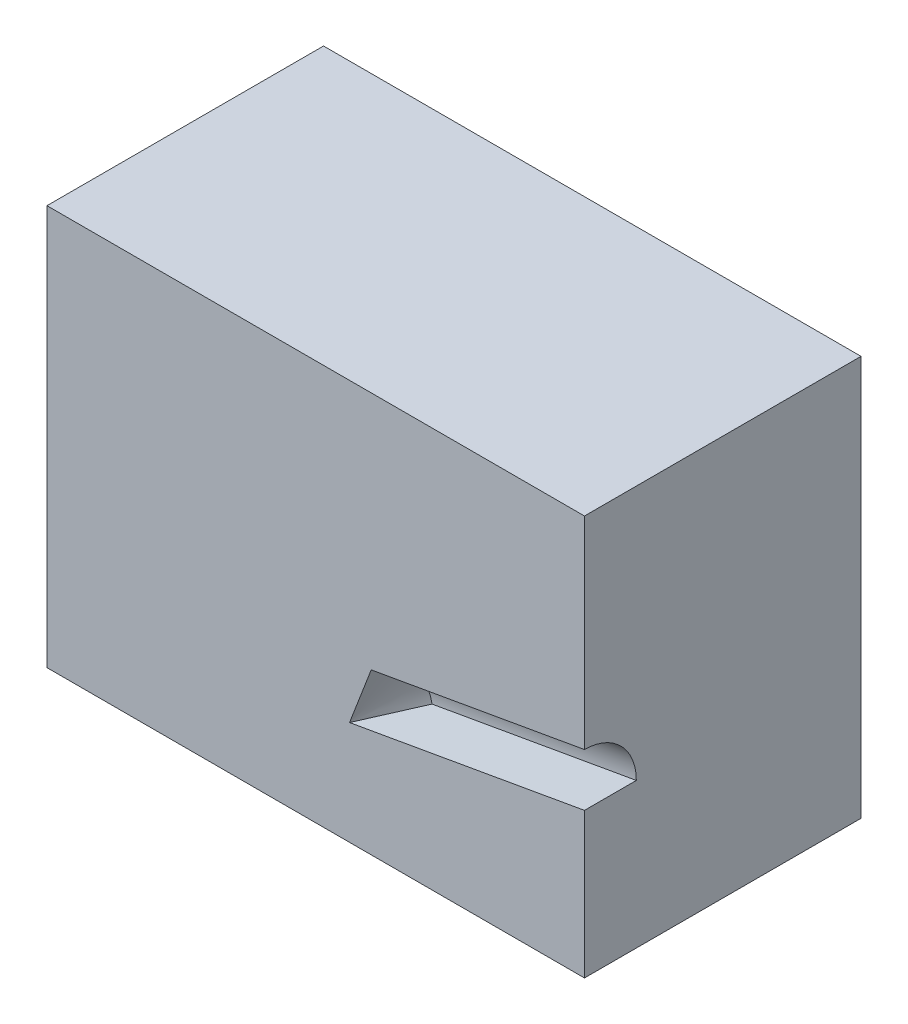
ISO-10303-21;
HEADER;
FILE_DESCRIPTION(('STEP AP214'),'2;1');
FILE_NAME('part.step','',(''),(''),'','','');
FILE_SCHEMA(('AUTOMOTIVE_DESIGN { 1 0 10303 214 1 1 1 1 }'));
ENDSEC;
DATA;
#1=APPLICATION_CONTEXT('core data for automotive mechanical design processes');
#2=APPLICATION_PROTOCOL_DEFINITION('international standard','automotive_design',2000,#1);
#3=PRODUCT_CONTEXT('',#1,'mechanical');
#4=PRODUCT('Part','Part','',(#3));
#5=PRODUCT_RELATED_PRODUCT_CATEGORY('part','',(#4));
#6=PRODUCT_DEFINITION_FORMATION('','',#4);
#7=PRODUCT_DEFINITION_CONTEXT('part definition',#1,'design');
#8=PRODUCT_DEFINITION('design','',#6,#7);
#9=PRODUCT_DEFINITION_SHAPE('','',#8);
#10=(LENGTH_UNIT() NAMED_UNIT(*) SI_UNIT(.MILLI.,.METRE.));
#11=(NAMED_UNIT(*) PLANE_ANGLE_UNIT() SI_UNIT($,.RADIAN.));
#12=(NAMED_UNIT(*) SI_UNIT($,.STERADIAN.) SOLID_ANGLE_UNIT());
#13=UNCERTAINTY_MEASURE_WITH_UNIT(LENGTH_MEASURE(1.E-05),#10,'distance_accuracy_value','');
#14=(GEOMETRIC_REPRESENTATION_CONTEXT(3) GLOBAL_UNCERTAINTY_ASSIGNED_CONTEXT((#13)) GLOBAL_UNIT_ASSIGNED_CONTEXT((#10,
#11,#12)) REPRESENTATION_CONTEXT('',''));
#15=CARTESIAN_POINT('',(0.,0.,0.));
#16=DIRECTION('',(0.,0.,1.));
#17=DIRECTION('',(1.,0.,0.));
#18=AXIS2_PLACEMENT_3D('',#15,#16,#17);
#19=CARTESIAN_POINT('',(0.,0.,-40.));
#20=DIRECTION('',(1.,0.,0.));
#21=DIRECTION('',(0.,0.,-1.));
#22=AXIS2_PLACEMENT_3D('',#19,#20,#21);
#23=PLANE('',#22);
#24=CARTESIAN_POINT('',(0.,21.,0.));
#25=DIRECTION('',(1.,0.,0.));
#26=DIRECTION('',(0.,1.,0.));
#27=AXIS2_PLACEMENT_3D('',#24,#25,#26);
#28=ELLIPSE('',#27,7.61569958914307,7.49999999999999);
#29=CARTESIAN_POINT('',(0.,21.,-7.49999999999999));
#30=VERTEX_POINT('',#29);
#31=CARTESIAN_POINT('',(0.,28.6156995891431,0.));
#32=VERTEX_POINT('',#31);
#33=EDGE_CURVE('E102',#30,#32,#28,.T.);
#34=ORIENTED_EDGE('',*,*,#33,.F.);
#35=DIRECTION('',(0.,0.,1.));
#36=VECTOR('',#35,1.);
#37=CARTESIAN_POINT('',(0.,20.9999999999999,-40.0000000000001));
#38=LINE('',#37,#36);
#39=CARTESIAN_POINT('',(0.,21.,0.));
#40=VERTEX_POINT('',#39);
#41=EDGE_CURVE('E110',#30,#40,#38,.T.);
#42=ORIENTED_EDGE('',*,*,#41,.T.);
#43=DIRECTION('',(0.,1.,0.));
#44=VECTOR('',#43,1.);
#45=CARTESIAN_POINT('',(0.,0.,0.));
#46=LINE('',#45,#44);
#47=CARTESIAN_POINT('',(0.,0.,0.));
#48=VERTEX_POINT('',#47);
#49=EDGE_CURVE('E135',#48,#40,#46,.T.);
#50=ORIENTED_EDGE('',*,*,#49,.F.);
#51=DIRECTION('',(0.,0.,1.));
#52=VECTOR('',#51,1.);
#53=CARTESIAN_POINT('',(0.,0.,-40.));
#54=LINE('',#53,#52);
#55=CARTESIAN_POINT('',(0.,0.,-40.));
#56=VERTEX_POINT('',#55);
#57=EDGE_CURVE('E38',#56,#48,#54,.T.);
#58=ORIENTED_EDGE('',*,*,#57,.F.);
#59=DIRECTION('',(0.,1.,0.));
#60=VECTOR('',#59,1.);
#61=CARTESIAN_POINT('',(0.,0.,-40.));
#62=LINE('',#61,#60);
#63=CARTESIAN_POINT('',(0.,57.8736347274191,-40.));
#64=VERTEX_POINT('',#63);
#65=EDGE_CURVE('E125',#56,#64,#62,.T.);
#66=ORIENTED_EDGE('',*,*,#65,.T.);
#67=DIRECTION('',(0.,0.,1.));
#68=VECTOR('',#67,1.);
#69=CARTESIAN_POINT('',(0.,57.8736347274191,-40.));
#70=LINE('',#69,#68);
#71=CARTESIAN_POINT('',(0.,57.8736347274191,0.));
#72=VERTEX_POINT('',#71);
#73=EDGE_CURVE('E80',#64,#72,#70,.T.);
#74=ORIENTED_EDGE('',*,*,#73,.T.);
#75=EDGE_CURVE('E124',#32,#72,#46,.T.);
#76=ORIENTED_EDGE('',*,*,#75,.F.);
#77=EDGE_LOOP('',(#34,#42,#50,#58,#66,#74,#76));
#78=FACE_BOUND('',#77,.T.);
#79=ADVANCED_FACE('F31',(#78),#23,.T.);
#80=CARTESIAN_POINT('',(0.,0.,-40.));
#81=DIRECTION('',(0.,-1.,0.));
#82=DIRECTION('',(0.,0.,-1.));
#83=AXIS2_PLACEMENT_3D('',#80,#81,#82);
#84=PLANE('',#83);
#85=DIRECTION('',(1.,0.,0.));
#86=VECTOR('',#85,1.);
#87=CARTESIAN_POINT('',(0.,0.,0.));
#88=LINE('',#87,#86);
#89=CARTESIAN_POINT('',(-77.7450331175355,0.,0.));
#90=VERTEX_POINT('',#89);
#91=EDGE_CURVE('E128',#90,#48,#88,.T.);
#92=ORIENTED_EDGE('',*,*,#91,.F.);
#93=DIRECTION('',(0.,0.,1.));
#94=VECTOR('',#93,1.);
#95=CARTESIAN_POINT('',(-77.7450331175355,0.,-40.));
#96=LINE('',#95,#94);
#97=CARTESIAN_POINT('',(-77.7450331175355,0.,-40.));
#98=VERTEX_POINT('',#97);
#99=EDGE_CURVE('E146',#98,#90,#96,.T.);
#100=ORIENTED_EDGE('',*,*,#99,.F.);
#101=DIRECTION('',(1.,0.,0.));
#102=VECTOR('',#101,1.);
#103=CARTESIAN_POINT('',(0.,0.,-40.));
#104=LINE('',#103,#102);
#105=EDGE_CURVE('E133',#98,#56,#104,.T.);
#106=ORIENTED_EDGE('',*,*,#105,.T.);
#107=ORIENTED_EDGE('',*,*,#57,.T.);
#108=EDGE_LOOP('',(#92,#100,#106,#107));
#109=FACE_BOUND('',#108,.T.);
#110=ADVANCED_FACE('F152',(#109),#84,.T.);
#111=CARTESIAN_POINT('',(-77.7450331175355,0.,-40.));
#112=DIRECTION('',(-1.,0.,0.));
#113=DIRECTION('',(0.,0.,1.));
#114=AXIS2_PLACEMENT_3D('',#111,#112,#113);
#115=PLANE('',#114);
#116=DIRECTION('',(0.,-1.,0.));
#117=VECTOR('',#116,1.);
#118=CARTESIAN_POINT('',(-77.7450331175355,0.,0.));
#119=LINE('',#118,#117);
#120=CARTESIAN_POINT('',(-77.7450331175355,57.8736347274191,0.));
#121=VERTEX_POINT('',#120);
#122=EDGE_CURVE('E140',#121,#90,#119,.T.);
#123=ORIENTED_EDGE('',*,*,#122,.F.);
#124=DIRECTION('',(0.,0.,1.));
#125=VECTOR('',#124,1.);
#126=CARTESIAN_POINT('',(-77.7450331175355,57.8736347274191,-40.));
#127=LINE('',#126,#125);
#128=CARTESIAN_POINT('',(-77.7450331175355,57.8736347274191,-40.));
#129=VERTEX_POINT('',#128);
#130=EDGE_CURVE('E148',#129,#121,#127,.T.);
#131=ORIENTED_EDGE('',*,*,#130,.F.);
#132=DIRECTION('',(0.,-1.,0.));
#133=VECTOR('',#132,1.);
#134=CARTESIAN_POINT('',(-77.7450331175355,0.,-40.));
#135=LINE('',#134,#133);
#136=EDGE_CURVE('E130',#129,#98,#135,.T.);
#137=ORIENTED_EDGE('',*,*,#136,.T.);
#138=ORIENTED_EDGE('',*,*,#99,.T.);
#139=EDGE_LOOP('',(#123,#131,#137,#138));
#140=FACE_BOUND('',#139,.T.);
#141=ADVANCED_FACE('F155',(#140),#115,.T.);
#142=CARTESIAN_POINT('',(0.,57.8736347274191,-40.));
#143=DIRECTION('',(0.,1.,0.));
#144=DIRECTION('',(0.,0.,1.));
#145=AXIS2_PLACEMENT_3D('',#142,#143,#144);
#146=PLANE('',#145);
#147=DIRECTION('',(-1.,0.,0.));
#148=VECTOR('',#147,1.);
#149=CARTESIAN_POINT('',(0.,57.8736347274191,0.));
#150=LINE('',#149,#148);
#151=EDGE_CURVE('E137',#72,#121,#150,.T.);
#152=ORIENTED_EDGE('',*,*,#151,.F.);
#153=ORIENTED_EDGE('',*,*,#73,.F.);
#154=DIRECTION('',(-1.,0.,0.));
#155=VECTOR('',#154,1.);
#156=CARTESIAN_POINT('',(0.,57.8736347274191,-40.));
#157=LINE('',#156,#155);
#158=EDGE_CURVE('E127',#64,#129,#157,.T.);
#159=ORIENTED_EDGE('',*,*,#158,.T.);
#160=ORIENTED_EDGE('',*,*,#130,.T.);
#161=EDGE_LOOP('',(#152,#153,#159,#160));
#162=FACE_BOUND('',#161,.T.);
#163=ADVANCED_FACE('F149',(#162),#146,.T.);
#164=CARTESIAN_POINT('',(0.,57.8736347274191,-40.));
#165=DIRECTION('',(0.,0.,1.));
#166=DIRECTION('',(1.,0.,0.));
#167=AXIS2_PLACEMENT_3D('',#164,#165,#166);
#168=PLANE('',#167);
#169=ORIENTED_EDGE('',*,*,#65,.F.);
#170=ORIENTED_EDGE('',*,*,#105,.F.);
#171=ORIENTED_EDGE('',*,*,#136,.F.);
#172=ORIENTED_EDGE('',*,*,#158,.F.);
#173=EDGE_LOOP('',(#169,#170,#171,#172));
#174=FACE_BOUND('',#173,.T.);
#175=ADVANCED_FACE('F157',(#174),#168,.F.);
#176=CARTESIAN_POINT('',(0.,57.8736347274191,0.));
#177=DIRECTION('',(0.,0.,1.));
#178=DIRECTION('',(1.,0.,0.));
#179=AXIS2_PLACEMENT_3D('',#176,#177,#178);
#180=PLANE('',#179);
#181=DIRECTION('',(0.984807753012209,0.173648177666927,0.));
#182=VECTOR('',#181,1.);
#183=CARTESIAN_POINT('',(-35.2845853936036,22.3940751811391,0.));
#184=LINE('',#183,#182);
#185=CARTESIAN_POINT('',(-30.8465939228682,23.1766128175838,0.));
#186=VERTEX_POINT('',#185);
#187=EDGE_CURVE('E11',#32,#186,#184,.F.);
#188=ORIENTED_EDGE('',*,*,#187,.F.);
#189=ORIENTED_EDGE('',*,*,#75,.T.);
#190=ORIENTED_EDGE('',*,*,#151,.T.);
#191=ORIENTED_EDGE('',*,*,#122,.T.);
#192=ORIENTED_EDGE('',*,*,#91,.T.);
#193=ORIENTED_EDGE('',*,*,#49,.T.);
#194=DIRECTION('',(0.984807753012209,0.173648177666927,0.));
#195=VECTOR('',#194,1.);
#196=CARTESIAN_POINT('',(-33.9822240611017,15.0080170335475,0.));
#197=LINE('',#196,#195);
#198=CARTESIAN_POINT('',(-33.9822240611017,15.0080170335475,0.));
#199=VERTEX_POINT('',#198);
#200=EDGE_CURVE('E115',#199,#40,#197,.T.);
#201=ORIENTED_EDGE('',*,*,#200,.F.);
#202=DIRECTION('',(-0.358367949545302,-0.933580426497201,0.));
#203=VECTOR('',#202,1.);
#204=CARTESIAN_POINT('',(-30.8465939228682,23.1766128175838,0.));
#205=LINE('',#204,#203);
#206=EDGE_CURVE('E108',#186,#199,#205,.T.);
#207=ORIENTED_EDGE('',*,*,#206,.F.);
#208=EDGE_LOOP('',(#188,#189,#190,#191,#192,#193,#201,#207));
#209=FACE_BOUND('',#208,.T.);
#210=ADVANCED_FACE('F113',(#209),#180,.T.);
#211=CARTESIAN_POINT('',(-29.5442325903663,15.7905546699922,0.));
#212=DIRECTION('',(0.984807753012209,0.173648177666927,0.));
#213=DIRECTION('',(-0.173648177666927,0.984807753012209,0.));
#214=AXIS2_PLACEMENT_3D('',#211,#212,#213);
#215=CONICAL_SURFACE('',#214,7.5,1.02974425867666);
#216=ORIENTED_EDGE('',*,*,#206,.T.);
#217=DIRECTION('',(-0.507213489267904,-0.0894354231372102,0.857167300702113));
#218=VECTOR('',#217,1.);
#219=CARTESIAN_POINT('',(-29.5442325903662,15.7905546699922,-7.5));
#220=LINE('',#219,#218);
#221=CARTESIAN_POINT('',(-29.5442325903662,15.7905546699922,-7.5));
#222=VERTEX_POINT('',#221);
#223=EDGE_CURVE('E45',#222,#199,#220,.T.);
#224=ORIENTED_EDGE('',*,*,#223,.F.);
#225=CARTESIAN_POINT('',(-29.5442325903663,15.7905546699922,0.));
#226=DIRECTION('',(0.984807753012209,0.173648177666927,0.));
#227=DIRECTION('',(-0.173648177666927,0.984807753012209,0.));
#228=AXIS2_PLACEMENT_3D('',#225,#226,#227);
#229=CIRCLE('',#228,7.5);
#230=EDGE_CURVE('E100',#222,#186,#229,.T.);
#231=ORIENTED_EDGE('',*,*,#230,.T.);
#232=EDGE_LOOP('',(#216,#224,#231));
#233=FACE_BOUND('',#232,.T.);
#234=ADVANCED_FACE('F107',(#233),#215,.F.);
#235=CARTESIAN_POINT('',(-33.9822240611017,15.0080170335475,0.));
#236=DIRECTION('',(0.984807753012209,0.173648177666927,0.));
#237=DIRECTION('',(-0.173648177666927,0.984807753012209,0.));
#238=AXIS2_PLACEMENT_3D('',#235,#236,#237);
#239=CYLINDRICAL_SURFACE('',#238,7.49999999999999);
#240=ORIENTED_EDGE('',*,*,#33,.T.);
#241=ORIENTED_EDGE('',*,*,#187,.T.);
#242=ORIENTED_EDGE('',*,*,#230,.F.);
#243=DIRECTION('',(-0.984807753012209,-0.173648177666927,0.));
#244=VECTOR('',#243,1.);
#245=CARTESIAN_POINT('',(-29.5442325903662,15.7905546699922,-7.5));
#246=LINE('',#245,#244);
#247=EDGE_CURVE('E111',#30,#222,#246,.T.);
#248=ORIENTED_EDGE('',*,*,#247,.F.);
#249=EDGE_LOOP('',(#240,#241,#242,#248));
#250=FACE_BOUND('',#249,.T.);
#251=ADVANCED_FACE('F98',(#250),#239,.F.);
#252=CARTESIAN_POINT('',(-33.9822240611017,15.0080170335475,0.));
#253=DIRECTION('',(-0.173648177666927,0.984807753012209,0.));
#254=DIRECTION('',(0.969846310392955,0.171010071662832,0.173648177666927));
#255=AXIS2_PLACEMENT_3D('',#252,#253,#254);
#256=PLANE('',#255);
#257=ORIENTED_EDGE('',*,*,#247,.T.);
#258=ORIENTED_EDGE('',*,*,#223,.T.);
#259=ORIENTED_EDGE('',*,*,#200,.T.);
#260=ORIENTED_EDGE('',*,*,#41,.F.);
#261=EDGE_LOOP('',(#257,#258,#259,#260));
#262=FACE_BOUND('',#261,.T.);
#263=ADVANCED_FACE('F206',(#262),#256,.T.);
#264=CLOSED_SHELL('',(#79,#110,#141,#163,#175,#210,#234,#251,#263));
#265=MANIFOLD_SOLID_BREP('B2',#264);
#266=ADVANCED_BREP_SHAPE_REPRESENTATION('',(#18,#265),#14);
#267=SHAPE_DEFINITION_REPRESENTATION(#9,#266);
ENDSEC;
END-ISO-10303-21;
